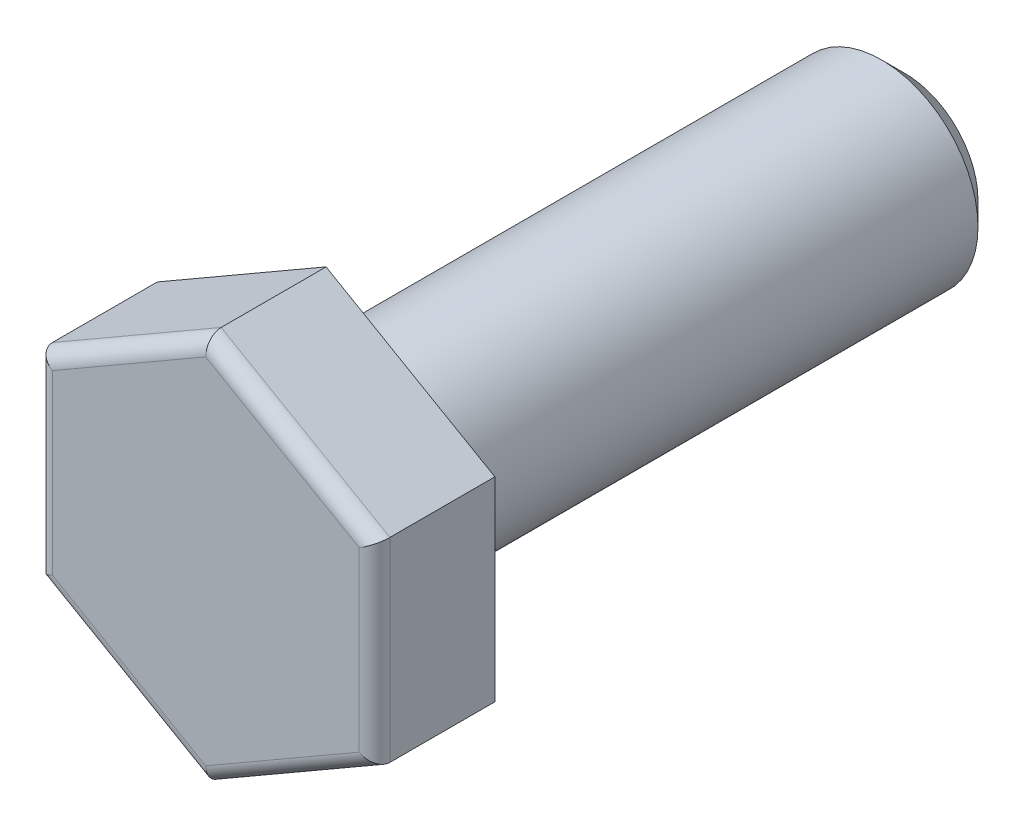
from build123d import *

# Parameters (mm, degrees)
HEAD_DEPTH          = 3.9624
SKETCH2_R           = 3.175
BOSS_EXTRUDE1_DEPTH = 19.05
CHAMFER1_SIZE       = 0.762
FILLET1_R           = 0.508


with BuildPart() as part:
    # Sketch1 → HEAD (new body)
    with BuildSketch(Plane.XY):
        Polygon((5.55625, 3.207902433), (0, 6.415804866), (-5.55625, 3.207902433), (-5.55625, -3.207902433), (0, -6.415804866), (5.55625, -3.207902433), align=None)
    extrude(amount=HEAD_DEPTH)

    # Sketch2 → Boss-Extrude1 (add)
    with BuildSketch(Plane(origin=(0, 0, 0), x_dir=(-1, 0, 0), z_dir=(0, 0, -1))):
        with Locations(Location((0, 0, 0), (0, 0, 180))):
            Circle(SKETCH2_R)
    extrude(amount=BOSS_EXTRUDE1_DEPTH)

    # Chamfer1
    chamfer1_edges = [part.edges().sort_by_distance(p)[0] for p in [
        (-3.175, 0, -19.05),
    ]]
    chamfer(chamfer1_edges, length=CHAMFER1_SIZE)

    # Fillet1
    fillet1_edges = [part.edges().sort_by_distance(p)[0] for p in [
        (2.778125, 4.81185365, 3.9624),
        (5.55625, 0, 3.9624),
        (-2.778125, 4.81185365, 3.9624),
        (2.778125, -4.81185365, 3.9624),
        (-5.55625, 0, 3.9624),
        (-2.778125, -4.81185365, 3.9624),
    ]]
    fillet(fillet1_edges, radius=FILLET1_R)


solid = part.part
